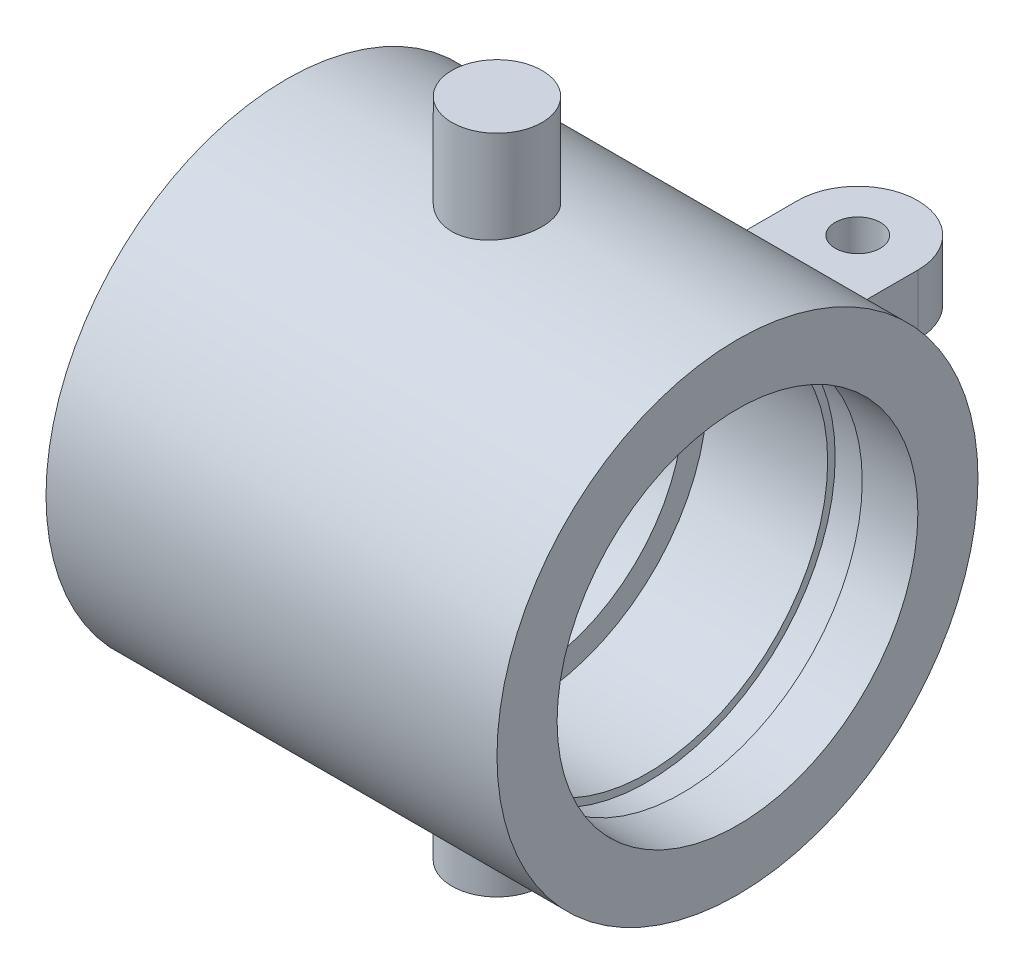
ISO-10303-21;
HEADER;
FILE_DESCRIPTION(('STEP AP214'),'2;1');
FILE_NAME('part.step','',(''),(''),'','','');
FILE_SCHEMA(('AUTOMOTIVE_DESIGN { 1 0 10303 214 1 1 1 1 }'));
ENDSEC;
DATA;
#1=APPLICATION_CONTEXT('core data for automotive mechanical design processes');
#2=APPLICATION_PROTOCOL_DEFINITION('international standard','automotive_design',2000,#1);
#3=PRODUCT_CONTEXT('',#1,'mechanical');
#4=PRODUCT('Part','Part','',(#3));
#5=PRODUCT_RELATED_PRODUCT_CATEGORY('part','',(#4));
#6=PRODUCT_DEFINITION_FORMATION('','',#4);
#7=PRODUCT_DEFINITION_CONTEXT('part definition',#1,'design');
#8=PRODUCT_DEFINITION('design','',#6,#7);
#9=PRODUCT_DEFINITION_SHAPE('','',#8);
#10=(LENGTH_UNIT() NAMED_UNIT(*) SI_UNIT(.MILLI.,.METRE.));
#11=(NAMED_UNIT(*) PLANE_ANGLE_UNIT() SI_UNIT($,.RADIAN.));
#12=(NAMED_UNIT(*) SI_UNIT($,.STERADIAN.) SOLID_ANGLE_UNIT());
#13=UNCERTAINTY_MEASURE_WITH_UNIT(LENGTH_MEASURE(1.E-05),#10,'distance_accuracy_value','');
#14=(GEOMETRIC_REPRESENTATION_CONTEXT(3) GLOBAL_UNCERTAINTY_ASSIGNED_CONTEXT((#13)) GLOBAL_UNIT_ASSIGNED_CONTEXT((#10,
#11,#12)) REPRESENTATION_CONTEXT('',''));
#15=CARTESIAN_POINT('',(0.,0.,0.));
#16=DIRECTION('',(0.,0.,1.));
#17=DIRECTION('',(1.,0.,0.));
#18=AXIS2_PLACEMENT_3D('',#15,#16,#17);
#19=CARTESIAN_POINT('',(53.,0.,0.));
#20=DIRECTION('',(1.,0.,0.));
#21=DIRECTION('',(0.,0.,-1.));
#22=AXIS2_PLACEMENT_3D('',#19,#20,#21);
#23=CYLINDRICAL_SURFACE('',#22,8.);
#24=CARTESIAN_POINT('',(68.,0.,0.));
#25=DIRECTION('',(1.,0.,0.));
#26=DIRECTION('',(0.,0.,-1.));
#27=AXIS2_PLACEMENT_3D('',#24,#25,#26);
#28=CIRCLE('',#27,8.);
#29=CARTESIAN_POINT('',(68.,0.,-8.));
#30=VERTEX_POINT('',#29);
#31=EDGE_CURVE('E123',#30,#30,#28,.T.);
#32=ORIENTED_EDGE('',*,*,#31,.F.);
#33=EDGE_LOOP('',(#32));
#34=FACE_BOUND('',#33,.T.);
#35=CARTESIAN_POINT('',(53.,0.,0.));
#36=DIRECTION('',(1.,0.,0.));
#37=DIRECTION('',(0.,0.,-1.));
#38=AXIS2_PLACEMENT_3D('',#35,#36,#37);
#39=CIRCLE('',#38,8.);
#40=CARTESIAN_POINT('',(53.,0.,-8.));
#41=VERTEX_POINT('',#40);
#42=EDGE_CURVE('E129',#41,#41,#39,.T.);
#43=ORIENTED_EDGE('',*,*,#42,.T.);
#44=EDGE_LOOP('',(#43));
#45=FACE_BOUND('',#44,.T.);
#46=CARTESIAN_POINT('',(60.,7.85811682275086,1.49999999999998));
#47=CARTESIAN_POINT('',(60.0834572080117,7.85811843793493,1.49999679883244));
#48=CARTESIAN_POINT('',(60.1669559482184,7.85946079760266,1.49301126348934));
#49=CARTESIAN_POINT('',(60.3315989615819,7.86467851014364,1.46527253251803));
#50=CARTESIAN_POINT('',(60.4127411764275,7.86855601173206,1.44450765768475));
#51=CARTESIAN_POINT('',(60.5702650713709,7.87838976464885,1.38987035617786));
#52=CARTESIAN_POINT('',(60.6466511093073,7.88434407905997,1.35601013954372));
#53=CARTESIAN_POINT('',(60.7926535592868,7.89765826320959,1.27617565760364));
#54=CARTESIAN_POINT('',(60.8622704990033,7.90501802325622,1.23020233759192));
#55=CARTESIAN_POINT('',(60.9936301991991,7.92041614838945,1.12683678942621));
#56=CARTESIAN_POINT('',(61.0552764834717,7.92846116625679,1.0693229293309));
#57=CARTESIAN_POINT('',(61.1681043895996,7.94426457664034,0.944771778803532));
#58=CARTESIAN_POINT('',(61.2192853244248,7.95202295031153,0.877733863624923));
#59=CARTESIAN_POINT('',(61.3100993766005,7.96645017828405,0.735403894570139));
#60=CARTESIAN_POINT('',(61.3496415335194,7.97311028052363,0.660052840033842));
#61=CARTESIAN_POINT('',(61.4154695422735,7.98451608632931,0.50363128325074));
#62=CARTESIAN_POINT('',(61.4417564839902,7.98926194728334,0.422561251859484));
#63=CARTESIAN_POINT('',(61.4800295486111,7.99625755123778,0.258002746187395));
#64=CARTESIAN_POINT('',(61.4921783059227,7.99853565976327,0.174553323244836));
#65=CARTESIAN_POINT('',(61.5023368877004,8.00043684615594,0.00677167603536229));
#66=CARTESIAN_POINT('',(61.5003479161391,8.00006015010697,-0.0775604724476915));
#67=CARTESIAN_POINT('',(61.4824122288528,7.99671633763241,-0.243598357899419));
#68=CARTESIAN_POINT('',(61.46664063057,7.99378172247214,-0.325323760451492));
#69=CARTESIAN_POINT('',(61.4218643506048,7.98568826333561,-0.484947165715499));
#70=CARTESIAN_POINT('',(61.3928591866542,7.98052933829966,-0.562845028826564));
#71=CARTESIAN_POINT('',(61.3222722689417,7.96851260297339,-0.713110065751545));
#72=CARTESIAN_POINT('',(61.2806205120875,7.96164537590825,-0.785443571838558));
#73=CARTESIAN_POINT('',(61.1859743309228,7.9469714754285,-0.922159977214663));
#74=CARTESIAN_POINT('',(61.1329787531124,7.93916470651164,-0.986542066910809));
#75=CARTESIAN_POINT('',(61.0161842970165,7.92333513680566,-1.10656561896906));
#76=CARTESIAN_POINT('',(60.9522322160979,7.91531085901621,-1.16205790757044));
#77=CARTESIAN_POINT('',(60.8158504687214,7.9000650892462,-1.26155171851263));
#78=CARTESIAN_POINT('',(60.7434206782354,7.8928436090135,-1.30555307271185));
#79=CARTESIAN_POINT('',(60.5919417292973,7.88001893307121,-1.3808585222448));
#80=CARTESIAN_POINT('',(60.5128815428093,7.8744185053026,-1.41214093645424));
#81=CARTESIAN_POINT('',(60.3504988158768,7.86551242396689,-1.46093656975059));
#82=CARTESIAN_POINT('',(60.2671767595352,7.86220651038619,-1.47845134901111));
#83=CARTESIAN_POINT('',(60.0999806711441,7.85831520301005,-1.49899672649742));
#84=CARTESIAN_POINT('',(60.0161338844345,7.85768955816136,-1.50224164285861));
#85=CARTESIAN_POINT('',(59.8490965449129,7.8591219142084,-1.49472968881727));
#86=CARTESIAN_POINT('',(59.7659059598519,7.86117978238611,-1.48397351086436));
#87=CARTESIAN_POINT('',(59.6032470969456,7.86770980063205,-1.44894868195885));
#88=CARTESIAN_POINT('',(59.5237537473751,7.87216186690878,-1.42479238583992));
#89=CARTESIAN_POINT('',(59.3699428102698,7.88296134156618,-1.36377224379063));
#90=CARTESIAN_POINT('',(59.2956256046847,7.88930888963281,-1.32690746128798));
#91=CARTESIAN_POINT('',(59.1533323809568,7.90327577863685,-1.24102353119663));
#92=CARTESIAN_POINT('',(59.0854394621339,7.91090895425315,-1.19186899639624));
#93=CARTESIAN_POINT('',(58.9587879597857,7.926548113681,-1.08298344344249));
#94=CARTESIAN_POINT('',(58.9000301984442,7.93455413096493,-1.02325147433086));
#95=CARTESIAN_POINT('',(58.7925162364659,7.95016624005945,-0.893949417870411));
#96=CARTESIAN_POINT('',(58.743904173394,7.95776555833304,-0.824258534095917));
#97=CARTESIAN_POINT('',(58.6590787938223,7.9715940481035,-0.677574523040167));
#98=CARTESIAN_POINT('',(58.622864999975,7.97782327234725,-0.600581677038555));
#99=CARTESIAN_POINT('',(58.5640799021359,7.98818057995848,-0.441877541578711));
#100=CARTESIAN_POINT('',(58.5414378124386,7.99231954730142,-0.360193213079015));
#101=CARTESIAN_POINT('',(58.5102129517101,7.99807642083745,-0.194096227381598));
#102=CARTESIAN_POINT('',(58.5016287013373,7.99969459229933,-0.109683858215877));
#103=CARTESIAN_POINT('',(58.4988146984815,8.00022227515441,0.058090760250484));
#104=CARTESIAN_POINT('',(58.5043672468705,7.99917286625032,0.141449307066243));
#105=CARTESIAN_POINT('',(58.5291924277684,7.99456866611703,0.306023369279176));
#106=CARTESIAN_POINT('',(58.5484649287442,7.99101389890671,0.387238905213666));
#107=CARTESIAN_POINT('',(58.6000912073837,7.98179837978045,0.545106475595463));
#108=CARTESIAN_POINT('',(58.632421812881,7.97614135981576,0.621766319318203));
#109=CARTESIAN_POINT('',(58.7092204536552,7.96333372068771,0.768605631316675));
#110=CARTESIAN_POINT('',(58.7536893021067,7.95618300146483,0.838784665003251));
#111=CARTESIAN_POINT('',(58.8542514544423,7.94104779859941,0.971755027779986));
#112=CARTESIAN_POINT('',(58.9105020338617,7.93305284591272,1.03442623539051));
#113=CARTESIAN_POINT('',(59.0327045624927,7.91719633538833,1.14951536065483));
#114=CARTESIAN_POINT('',(59.0986587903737,7.90933480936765,1.20193086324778));
#115=CARTESIAN_POINT('',(59.2391264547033,7.89455577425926,1.29547633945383));
#116=CARTESIAN_POINT('',(59.3137134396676,7.88764767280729,1.3364974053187));
#117=CARTESIAN_POINT('',(59.4688257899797,7.87567084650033,1.40536132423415));
#118=CARTESIAN_POINT('',(59.5493454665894,7.87060038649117,1.4332166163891));
#119=CARTESIAN_POINT('',(59.6917522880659,7.86393016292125,1.46929726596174));
#120=CARTESIAN_POINT('',(59.7528057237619,7.86176310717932,1.48079105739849));
#121=CARTESIAN_POINT('',(59.8758984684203,7.85885585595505,1.49614351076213));
#122=CARTESIAN_POINT('',(59.9379377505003,7.85811562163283,1.50000238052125));
#123=CARTESIAN_POINT('',(60.,7.85811682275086,1.49999999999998));
#124=B_SPLINE_CURVE_WITH_KNOTS('',3,(#46,#47,#48,#49,#50,#51,#52,#53,#54,#55,#56,#57,#58,#59,
#60,#61,#62,#63,#64,#65,#66,#67,#68,#69,#70,#71,#72,#73,#74,#75,#76,#77,#78,#79,#80,#81,#82,#83,
#84,#85,#86,#87,#88,#89,#90,#91,#92,#93,#94,#95,#96,#97,#98,#99,#100,#101,#102,#103,#104,#105,
#106,#107,#108,#109,#110,#111,#112,#113,#114,#115,#116,#117,#118,#119,#120,#121,#122,#123),
.UNSPECIFIED.,.T.,.F.,(4,2,2,2,2,2,2,2,2,2,2,2,2,2,2,2,2,2,2,2,2,2,2,2,2,2,2,2,2,2,2,2,2,2,2,2,
2,2,4),(0.,0.250144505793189,0.500501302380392,0.750625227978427,1.00072963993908,
1.25362335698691,1.50653367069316,1.76137104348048,2.01618745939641,2.26804275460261,
2.51987660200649,2.76855650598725,3.01724547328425,3.2673369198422,3.51745380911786,
3.77140614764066,4.02536220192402,4.27974936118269,4.53410768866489,4.78463248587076,
5.03514489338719,5.28358792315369,5.53204926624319,5.78337862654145,6.03473059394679,
6.28944125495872,6.54414210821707,6.79750269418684,7.05083661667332,7.3002930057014,
7.54974700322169,7.7987602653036,8.04779021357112,8.30038464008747,8.55303847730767,
8.8080300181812,9.06278015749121,9.24880307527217,9.43482092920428),.UNSPECIFIED.);
#125=CARTESIAN_POINT('',(60.,7.85811682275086,1.49999999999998));
#126=VERTEX_POINT('',#125);
#127=EDGE_CURVE('E132',#126,#126,#124,.T.);
#128=ORIENTED_EDGE('',*,*,#127,.F.);
#129=EDGE_LOOP('',(#128));
#130=FACE_BOUND('',#129,.T.);
#131=CARTESIAN_POINT('',(61.5,-8.,0.));
#132=CARTESIAN_POINT('',(61.4999968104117,-7.99999848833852,0.0834717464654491));
#133=CARTESIAN_POINT('',(61.4930089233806,-7.99868009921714,0.166984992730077));
#134=CARTESIAN_POINT('',(61.4652600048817,-7.9935478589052,0.331658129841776));
#135=CARTESIAN_POINT('',(61.4444873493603,-7.98973190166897,0.412815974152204));
#136=CARTESIAN_POINT('',(61.3898272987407,-7.98003138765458,0.570372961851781));
#137=CARTESIAN_POINT('',(61.3559517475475,-7.97414869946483,0.646776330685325));
#138=CARTESIAN_POINT('',(61.2760811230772,-7.96095710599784,0.792807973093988));
#139=CARTESIAN_POINT('',(61.2300870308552,-7.9536483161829,0.862436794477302));
#140=CARTESIAN_POINT('',(61.1267002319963,-7.93831336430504,0.993783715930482));
#141=CARTESIAN_POINT('',(61.0691905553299,-7.93028034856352,1.05540895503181));
#142=CARTESIAN_POINT('',(60.9446566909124,-7.91445318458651,1.16819606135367));
#143=CARTESIAN_POINT('',(60.8776318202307,-7.90665905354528,1.21935717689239));
#144=CARTESIAN_POINT('',(60.735313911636,-7.89212551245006,1.31014998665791));
#145=CARTESIAN_POINT('',(60.6599596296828,-7.88539493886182,1.34968721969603));
#146=CARTESIAN_POINT('',(60.5035310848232,-7.87384713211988,1.41550524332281));
#147=CARTESIAN_POINT('',(60.4224573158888,-7.86902973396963,1.44178717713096));
#148=CARTESIAN_POINT('',(60.2578847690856,-7.8619226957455,1.48005053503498));
#149=CARTESIAN_POINT('',(60.1744249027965,-7.85960445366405,1.49219390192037));
#150=CARTESIAN_POINT('',(60.0066226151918,-7.85767197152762,1.50233808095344));
#151=CARTESIAN_POINT('',(59.9222802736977,-7.8580574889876,1.50034016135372));
#152=CARTESIAN_POINT('',(59.756280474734,-7.86146292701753,1.48238979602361));
#153=CARTESIAN_POINT('',(59.6746022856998,-7.86444808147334,1.46662149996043));
#154=CARTESIAN_POINT('',(59.5150715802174,-7.87266183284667,1.42186799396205));
#155=CARTESIAN_POINT('',(59.4372192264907,-7.87789052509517,1.39288222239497));
#156=CARTESIAN_POINT('',(59.2870113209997,-7.89003855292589,1.32233647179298));
#157=CARTESIAN_POINT('',(59.2146915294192,-7.89696783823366,1.28070213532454));
#158=CARTESIAN_POINT('',(59.0779952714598,-7.91172971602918,1.18609368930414));
#159=CARTESIAN_POINT('',(59.0136196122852,-7.91956240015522,1.13311842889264));
#160=CARTESIAN_POINT('',(58.8935750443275,-7.93540001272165,1.01633905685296));
#161=CARTESIAN_POINT('',(58.8380593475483,-7.94340571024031,0.952377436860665));
#162=CARTESIAN_POINT('',(58.7385227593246,-7.95857386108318,0.815968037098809));
#163=CARTESIAN_POINT('',(58.6945019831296,-7.96573630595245,0.743520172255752));
#164=CARTESIAN_POINT('',(58.61918224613,-7.97842539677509,0.59203498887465));
#165=CARTESIAN_POINT('',(58.5878992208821,-7.98394999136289,0.512989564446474));
#166=CARTESIAN_POINT('',(58.5390979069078,-7.99272505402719,0.350639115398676));
#167=CARTESIAN_POINT('',(58.5215781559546,-7.99597576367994,0.267334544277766));
#168=CARTESIAN_POINT('',(58.5010139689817,-7.99980360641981,0.100148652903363));
#169=CARTESIAN_POINT('',(58.4977596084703,-8.00041950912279,0.0162940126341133));
#170=CARTESIAN_POINT('',(58.5052554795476,-7.99901543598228,-0.150761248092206));
#171=CARTESIAN_POINT('',(58.5160050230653,-7.99699558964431,-0.233961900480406));
#172=CARTESIAN_POINT('',(58.5510290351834,-7.99057111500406,-0.396681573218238));
#173=CARTESIAN_POINT('',(58.5751972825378,-7.98618522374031,-0.476224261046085));
#174=CARTESIAN_POINT('',(58.6362577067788,-7.97551842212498,-0.630128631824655));
#175=CARTESIAN_POINT('',(58.6731507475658,-7.96923738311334,-0.704489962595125));
#176=CARTESIAN_POINT('',(58.7590781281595,-7.95538030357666,-0.846816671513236));
#177=CARTESIAN_POINT('',(58.8082407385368,-7.94779086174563,-0.914703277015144));
#178=CARTESIAN_POINT('',(58.9171381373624,-7.93219343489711,-1.04133832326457));
#179=CARTESIAN_POINT('',(58.9768739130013,-7.92418541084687,-1.10008590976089));
#180=CARTESIAN_POINT('',(59.1061723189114,-7.9085247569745,-1.2075729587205));
#181=CARTESIAN_POINT('',(59.1758549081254,-7.90087825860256,-1.25616916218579));
#182=CARTESIAN_POINT('',(59.3225176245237,-7.88692985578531,-1.34096675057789));
#183=CARTESIAN_POINT('',(59.3994974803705,-7.88062790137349,-1.37716859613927));
#184=CARTESIAN_POINT('',(59.5582058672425,-7.87013024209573,-1.43594673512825));
#185=CARTESIAN_POINT('',(59.6399093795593,-7.86592440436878,-1.45858868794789));
#186=CARTESIAN_POINT('',(59.8060472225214,-7.86007203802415,-1.48980679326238));
#187=CARTESIAN_POINT('',(59.8904812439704,-7.85842522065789,-1.49838453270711));
#188=CARTESIAN_POINT('',(60.0582483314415,-7.85789199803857,-1.50117762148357));
#189=CARTESIAN_POINT('',(60.141577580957,-7.85896215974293,-1.49561895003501));
#190=CARTESIAN_POINT('',(60.3060914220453,-7.86364600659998,-1.47079175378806));
#191=CARTESIAN_POINT('',(60.3872760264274,-7.86725967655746,-1.45152331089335));
#192=CARTESIAN_POINT('',(60.5450744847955,-7.87660508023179,-1.39991887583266));
#193=CARTESIAN_POINT('',(60.6216965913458,-7.88233284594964,-1.36760735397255));
#194=CARTESIAN_POINT('',(60.7684682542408,-7.8952638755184,-1.29085868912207));
#195=CARTESIAN_POINT('',(60.8386173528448,-7.90246724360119,-1.24642068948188));
#196=CARTESIAN_POINT('',(60.9715836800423,-7.91767266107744,-1.14589487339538));
#197=CARTESIAN_POINT('',(61.0342754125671,-7.92568505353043,-1.08964259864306));
#198=CARTESIAN_POINT('',(61.1494051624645,-7.94152833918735,-0.967427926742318));
#199=CARTESIAN_POINT('',(61.2018408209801,-7.94935919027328,-0.901463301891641));
#200=CARTESIAN_POINT('',(61.2954109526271,-7.96403975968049,-0.760984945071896));
#201=CARTESIAN_POINT('',(61.3364394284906,-7.97088000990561,-0.686399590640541));
#202=CARTESIAN_POINT('',(61.4053176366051,-7.98271619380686,-0.531290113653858));
#203=CARTESIAN_POINT('',(61.4331797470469,-7.98771385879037,-0.450771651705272));
#204=CARTESIAN_POINT('',(61.4692773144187,-7.99428290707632,-0.308347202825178));
#205=CARTESIAN_POINT('',(61.4807786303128,-7.99641470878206,-0.247273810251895));
#206=CARTESIAN_POINT('',(61.4961410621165,-7.9992737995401,-0.124141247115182));
#207=CARTESIAN_POINT('',(61.5000023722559,-8.00000112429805,-0.0620821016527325));
#208=CARTESIAN_POINT('',(61.5,-8.,0.));
#209=B_SPLINE_CURVE_WITH_KNOTS('',3,(#131,#132,#133,#134,#135,#136,#137,#138,#139,#140,#141,
#142,#143,#144,#145,#146,#147,#148,#149,#150,#151,#152,#153,#154,#155,#156,#157,#158,#159,#160,
#161,#162,#163,#164,#165,#166,#167,#168,#169,#170,#171,#172,#173,#174,#175,#176,#177,#178,#179,
#180,#181,#182,#183,#184,#185,#186,#187,#188,#189,#190,#191,#192,#193,#194,#195,#196,#197,#198,
#199,#200,#201,#202,#203,#204,#205,#206,#207,#208),.UNSPECIFIED.,.T.,.F.,(4,2,2,2,2,2,2,2,2,2,2,
2,2,2,2,2,2,2,2,2,2,2,2,2,2,2,2,2,2,2,2,2,2,2,2,2,2,2,4),(0.,0.250188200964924,
0.500587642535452,0.75076127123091,1.00091465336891,1.2537511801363,1.50660586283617,
1.76146190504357,2.01629596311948,2.26818151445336,2.52004447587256,2.76859000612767,
3.01714609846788,3.26719262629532,3.5172645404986,3.77127768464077,4.02529337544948,
4.27962588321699,4.53393136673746,4.78448174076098,5.03501980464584,5.28360233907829,
5.53220175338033,5.7835177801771,6.03485728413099,6.28953436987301,6.54420198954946,
6.7976262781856,7.05102196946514,7.30039252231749,7.54976158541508,7.79866496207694,
8.04758592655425,8.30023369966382,8.55293951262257,8.80792048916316,9.06266126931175,
9.24874344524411,9.43482089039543),.UNSPECIFIED.);
#210=CARTESIAN_POINT('',(61.5,-8.,0.));
#211=VERTEX_POINT('',#210);
#212=EDGE_CURVE('E142',#211,#211,#209,.T.);
#213=ORIENTED_EDGE('',*,*,#212,.F.);
#214=EDGE_LOOP('',(#213));
#215=FACE_BOUND('',#214,.T.);
#216=DIRECTION('',(1.,0.,0.));
#217=VECTOR('',#216,1.);
#218=CARTESIAN_POINT('',(53.,-1.,-7.93725393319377));
#219=LINE('',#218,#217);
#220=CARTESIAN_POINT('',(62.,-1.,-7.93725393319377));
#221=VERTEX_POINT('',#220);
#222=CARTESIAN_POINT('',(58.,-1.,-7.93725393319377));
#223=VERTEX_POINT('',#222);
#224=EDGE_CURVE('E40',#221,#223,#219,.F.);
#225=ORIENTED_EDGE('',*,*,#224,.F.);
#226=CARTESIAN_POINT('',(62.,0.,0.));
#227=DIRECTION('',(-1.,0.,0.));
#228=DIRECTION('',(0.,0.,1.));
#229=AXIS2_PLACEMENT_3D('',#226,#227,#228);
#230=CIRCLE('',#229,8.);
#231=CARTESIAN_POINT('',(62.,1.,-7.93725393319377));
#232=VERTEX_POINT('',#231);
#233=EDGE_CURVE('E94',#221,#232,#230,.F.);
#234=ORIENTED_EDGE('',*,*,#233,.T.);
#235=DIRECTION('',(1.,0.,0.));
#236=VECTOR('',#235,1.);
#237=CARTESIAN_POINT('',(53.,1.,-7.93725393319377));
#238=LINE('',#237,#236);
#239=CARTESIAN_POINT('',(58.,1.,-7.93725393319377));
#240=VERTEX_POINT('',#239);
#241=EDGE_CURVE('E11',#232,#240,#238,.F.);
#242=ORIENTED_EDGE('',*,*,#241,.T.);
#243=CARTESIAN_POINT('',(58.,0.,0.));
#244=DIRECTION('',(1.,0.,0.));
#245=DIRECTION('',(0.,0.,-1.));
#246=AXIS2_PLACEMENT_3D('',#243,#244,#245);
#247=CIRCLE('',#246,8.);
#248=EDGE_CURVE('E52',#240,#223,#247,.F.);
#249=ORIENTED_EDGE('',*,*,#248,.T.);
#250=EDGE_LOOP('',(#225,#234,#242,#249));
#251=FACE_BOUND('',#250,.T.);
#252=ADVANCED_FACE('F32',(#34,#45,#130,#215,#251),#23,.T.);
#253=CARTESIAN_POINT('',(61.,0.,0.));
#254=DIRECTION('',(1.,0.,0.));
#255=DIRECTION('',(0.,0.,-1.));
#256=AXIS2_PLACEMENT_3D('',#253,#254,#255);
#257=CYLINDRICAL_SURFACE('',#256,6.);
#258=CARTESIAN_POINT('',(66.15,0.,0.));
#259=DIRECTION('',(1.,0.,0.));
#260=DIRECTION('',(0.,0.,-1.));
#261=AXIS2_PLACEMENT_3D('',#258,#259,#260);
#262=CIRCLE('',#261,6.);
#263=CARTESIAN_POINT('',(66.15,0.,-6.));
#264=VERTEX_POINT('',#263);
#265=EDGE_CURVE('E119',#264,#264,#262,.T.);
#266=ORIENTED_EDGE('',*,*,#265,.F.);
#267=EDGE_LOOP('',(#266));
#268=FACE_BOUND('',#267,.T.);
#269=CARTESIAN_POINT('',(68.,0.,0.));
#270=DIRECTION('',(1.,0.,0.));
#271=DIRECTION('',(0.,0.,-1.));
#272=AXIS2_PLACEMENT_3D('',#269,#270,#271);
#273=CIRCLE('',#272,6.);
#274=CARTESIAN_POINT('',(68.,0.,-6.));
#275=VERTEX_POINT('',#274);
#276=EDGE_CURVE('E120',#275,#275,#273,.T.);
#277=ORIENTED_EDGE('',*,*,#276,.T.);
#278=EDGE_LOOP('',(#277));
#279=FACE_BOUND('',#278,.T.);
#280=ADVANCED_FACE('F177',(#268,#279),#257,.F.);
#281=CARTESIAN_POINT('',(68.,0.,0.));
#282=DIRECTION('',(1.,0.,0.));
#283=DIRECTION('',(0.,0.,-1.));
#284=AXIS2_PLACEMENT_3D('',#281,#282,#283);
#285=PLANE('',#284);
#286=ORIENTED_EDGE('',*,*,#31,.T.);
#287=EDGE_LOOP('',(#286));
#288=FACE_BOUND('',#287,.T.);
#289=ORIENTED_EDGE('',*,*,#276,.F.);
#290=EDGE_LOOP('',(#289));
#291=FACE_BOUND('',#290,.T.);
#292=ADVANCED_FACE('F174',(#288,#291),#285,.T.);
#293=CARTESIAN_POINT('',(53.,0.,0.));
#294=DIRECTION('',(1.,0.,0.));
#295=DIRECTION('',(0.,0.,-1.));
#296=AXIS2_PLACEMENT_3D('',#293,#294,#295);
#297=PLANE('',#296);
#298=CARTESIAN_POINT('',(53.,0.,0.));
#299=DIRECTION('',(1.,0.,0.));
#300=DIRECTION('',(0.,0.,-1.));
#301=AXIS2_PLACEMENT_3D('',#298,#299,#300);
#302=CIRCLE('',#301,5.2);
#303=CARTESIAN_POINT('',(53.,0.,-5.2));
#304=VERTEX_POINT('',#303);
#305=EDGE_CURVE('E107',#304,#304,#302,.T.);
#306=ORIENTED_EDGE('',*,*,#305,.T.);
#307=EDGE_LOOP('',(#306));
#308=FACE_BOUND('',#307,.T.);
#309=ORIENTED_EDGE('',*,*,#42,.F.);
#310=EDGE_LOOP('',(#309));
#311=FACE_BOUND('',#310,.T.);
#312=ADVANCED_FACE('F172',(#308,#311),#297,.F.);
#313=CARTESIAN_POINT('',(66.15,0.,0.));
#314=DIRECTION('',(-1.,0.,0.));
#315=DIRECTION('',(0.,0.,1.));
#316=AXIS2_PLACEMENT_3D('',#313,#314,#315);
#317=CYLINDRICAL_SURFACE('',#316,6.25);
#318=CARTESIAN_POINT('',(66.15,0.,0.));
#319=DIRECTION('',(1.,0.,0.));
#320=DIRECTION('',(0.,0.,-1.));
#321=AXIS2_PLACEMENT_3D('',#318,#319,#320);
#322=CIRCLE('',#321,6.25);
#323=CARTESIAN_POINT('',(66.15,0.,-6.25));
#324=VERTEX_POINT('',#323);
#325=EDGE_CURVE('E111',#324,#324,#322,.T.);
#326=ORIENTED_EDGE('',*,*,#325,.T.);
#327=EDGE_LOOP('',(#326));
#328=FACE_BOUND('',#327,.T.);
#329=CARTESIAN_POINT('',(65.,0.,0.));
#330=DIRECTION('',(1.,0.,0.));
#331=DIRECTION('',(0.,0.,-1.));
#332=AXIS2_PLACEMENT_3D('',#329,#330,#331);
#333=CIRCLE('',#332,6.25);
#334=CARTESIAN_POINT('',(65.,0.,-6.25));
#335=VERTEX_POINT('',#334);
#336=EDGE_CURVE('E110',#335,#335,#333,.T.);
#337=ORIENTED_EDGE('',*,*,#336,.F.);
#338=EDGE_LOOP('',(#337));
#339=FACE_BOUND('',#338,.T.);
#340=ADVANCED_FACE('F164',(#328,#339),#317,.F.);
#341=CARTESIAN_POINT('',(66.15,0.,0.));
#342=DIRECTION('',(1.,0.,0.));
#343=DIRECTION('',(0.,0.,-1.));
#344=AXIS2_PLACEMENT_3D('',#341,#342,#343);
#345=PLANE('',#344);
#346=ORIENTED_EDGE('',*,*,#265,.T.);
#347=EDGE_LOOP('',(#346));
#348=FACE_BOUND('',#347,.T.);
#349=ORIENTED_EDGE('',*,*,#325,.F.);
#350=EDGE_LOOP('',(#349));
#351=FACE_BOUND('',#350,.T.);
#352=ADVANCED_FACE('F160',(#348,#351),#345,.F.);
#353=CARTESIAN_POINT('',(65.,0.,0.));
#354=DIRECTION('',(1.,0.,0.));
#355=DIRECTION('',(0.,0.,-1.));
#356=AXIS2_PLACEMENT_3D('',#353,#354,#355);
#357=PLANE('',#356);
#358=CARTESIAN_POINT('',(65.,0.,0.));
#359=DIRECTION('',(1.,0.,0.));
#360=DIRECTION('',(0.,0.,-1.));
#361=AXIS2_PLACEMENT_3D('',#358,#359,#360);
#362=CIRCLE('',#361,6.);
#363=CARTESIAN_POINT('',(65.,0.,-6.));
#364=VERTEX_POINT('',#363);
#365=EDGE_CURVE('E114',#364,#364,#362,.T.);
#366=ORIENTED_EDGE('',*,*,#365,.F.);
#367=EDGE_LOOP('',(#366));
#368=FACE_BOUND('',#367,.T.);
#369=ORIENTED_EDGE('',*,*,#336,.T.);
#370=EDGE_LOOP('',(#369));
#371=FACE_BOUND('',#370,.T.);
#372=ADVANCED_FACE('F163',(#368,#371),#357,.T.);
#373=CARTESIAN_POINT('',(61.,0.,0.));
#374=DIRECTION('',(-1.,0.,0.));
#375=DIRECTION('',(0.,0.,1.));
#376=AXIS2_PLACEMENT_3D('',#373,#374,#375);
#377=PLANE('',#376);
#378=CARTESIAN_POINT('',(61.,0.,0.));
#379=DIRECTION('',(-1.,0.,0.));
#380=DIRECTION('',(0.,0.,1.));
#381=AXIS2_PLACEMENT_3D('',#378,#379,#380);
#382=CIRCLE('',#381,5.2);
#383=CARTESIAN_POINT('',(61.,0.,5.2));
#384=VERTEX_POINT('',#383);
#385=EDGE_CURVE('E106',#384,#384,#382,.T.);
#386=ORIENTED_EDGE('',*,*,#385,.T.);
#387=EDGE_LOOP('',(#386));
#388=FACE_BOUND('',#387,.T.);
#389=CARTESIAN_POINT('',(61.,0.,0.));
#390=DIRECTION('',(-1.,0.,0.));
#391=DIRECTION('',(0.,0.,1.));
#392=AXIS2_PLACEMENT_3D('',#389,#390,#391);
#393=CIRCLE('',#392,6.);
#394=CARTESIAN_POINT('',(61.,0.,6.));
#395=VERTEX_POINT('',#394);
#396=EDGE_CURVE('E126',#395,#395,#393,.T.);
#397=ORIENTED_EDGE('',*,*,#396,.F.);
#398=EDGE_LOOP('',(#397));
#399=FACE_BOUND('',#398,.T.);
#400=ADVANCED_FACE('F168',(#388,#399),#377,.F.);
#401=ORIENTED_EDGE('',*,*,#396,.T.);
#402=EDGE_LOOP('',(#401));
#403=FACE_BOUND('',#402,.T.);
#404=ORIENTED_EDGE('',*,*,#365,.T.);
#405=EDGE_LOOP('',(#404));
#406=FACE_BOUND('',#405,.T.);
#407=ADVANCED_FACE('F158',(#403,#406),#257,.F.);
#408=CARTESIAN_POINT('',(-90.,0.,0.));
#409=DIRECTION('',(1.,0.,0.));
#410=DIRECTION('',(0.,0.,-1.));
#411=AXIS2_PLACEMENT_3D('',#408,#409,#410);
#412=CYLINDRICAL_SURFACE('',#411,5.2);
#413=ORIENTED_EDGE('',*,*,#385,.F.);
#414=EDGE_LOOP('',(#413));
#415=FACE_BOUND('',#414,.T.);
#416=ORIENTED_EDGE('',*,*,#305,.F.);
#417=EDGE_LOOP('',(#416));
#418=FACE_BOUND('',#417,.T.);
#419=ADVANCED_FACE('F155',(#415,#418),#412,.F.);
#420=CARTESIAN_POINT('',(60.,11.,0.));
#421=DIRECTION('',(0.,1.,0.));
#422=DIRECTION('',(0.,0.,1.));
#423=AXIS2_PLACEMENT_3D('',#420,#421,#422);
#424=PLANE('',#423);
#425=CARTESIAN_POINT('',(60.,11.,0.));
#426=DIRECTION('',(0.,1.,0.));
#427=DIRECTION('',(0.,0.,1.));
#428=AXIS2_PLACEMENT_3D('',#425,#426,#427);
#429=CIRCLE('',#428,1.5);
#430=CARTESIAN_POINT('',(60.,11.,1.49999999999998));
#431=VERTEX_POINT('',#430);
#432=EDGE_CURVE('E103',#431,#431,#429,.T.);
#433=ORIENTED_EDGE('',*,*,#432,.T.);
#434=EDGE_LOOP('',(#433));
#435=FACE_BOUND('',#434,.T.);
#436=ADVANCED_FACE('F153',(#435),#424,.T.);
#437=CARTESIAN_POINT('',(60.,-18.001,0.));
#438=DIRECTION('',(0.,1.,0.));
#439=DIRECTION('',(0.,0.,1.));
#440=AXIS2_PLACEMENT_3D('',#437,#438,#439);
#441=CYLINDRICAL_SURFACE('',#440,1.5);
#442=ORIENTED_EDGE('',*,*,#127,.T.);
#443=EDGE_LOOP('',(#442));
#444=FACE_BOUND('',#443,.T.);
#445=ORIENTED_EDGE('',*,*,#432,.F.);
#446=EDGE_LOOP('',(#445));
#447=FACE_BOUND('',#446,.T.);
#448=ADVANCED_FACE('F147',(#444,#447),#441,.T.);
#449=CARTESIAN_POINT('',(60.,-11.,0.));
#450=DIRECTION('',(0.,-1.,0.));
#451=DIRECTION('',(1.,0.,0.));
#452=AXIS2_PLACEMENT_3D('',#449,#450,#451);
#453=PLANE('',#452);
#454=CARTESIAN_POINT('',(60.,-11.,0.));
#455=DIRECTION('',(0.,-1.,0.));
#456=DIRECTION('',(1.,0.,0.));
#457=AXIS2_PLACEMENT_3D('',#454,#455,#456);
#458=CIRCLE('',#457,1.5);
#459=CARTESIAN_POINT('',(61.5,-11.,0.));
#460=VERTEX_POINT('',#459);
#461=EDGE_CURVE('E96',#460,#460,#458,.T.);
#462=ORIENTED_EDGE('',*,*,#461,.T.);
#463=EDGE_LOOP('',(#462));
#464=FACE_BOUND('',#463,.T.);
#465=ADVANCED_FACE('F152',(#464),#453,.T.);
#466=CARTESIAN_POINT('',(60.,11.001,0.));
#467=DIRECTION('',(0.,-1.,0.));
#468=DIRECTION('',(1.,0.,0.));
#469=AXIS2_PLACEMENT_3D('',#466,#467,#468);
#470=CYLINDRICAL_SURFACE('',#469,1.5);
#471=ORIENTED_EDGE('',*,*,#212,.T.);
#472=EDGE_LOOP('',(#471));
#473=FACE_BOUND('',#472,.T.);
#474=ORIENTED_EDGE('',*,*,#461,.F.);
#475=EDGE_LOOP('',(#474));
#476=FACE_BOUND('',#475,.T.);
#477=ADVANCED_FACE('F205',(#473,#476),#470,.T.);
#478=CARTESIAN_POINT('',(60.,1.,-12.));
#479=DIRECTION('',(0.,-1.,0.));
#480=DIRECTION('',(0.,0.,-1.));
#481=AXIS2_PLACEMENT_3D('',#478,#479,#480);
#482=PLANE('',#481);
#483=ORIENTED_EDGE('',*,*,#241,.F.);
#484=DIRECTION('',(0.,0.,-1.));
#485=VECTOR('',#484,1.);
#486=CARTESIAN_POINT('',(62.,1.,-12.));
#487=LINE('',#486,#485);
#488=CARTESIAN_POINT('',(62.,1.,-12.));
#489=VERTEX_POINT('',#488);
#490=EDGE_CURVE('E73',#232,#489,#487,.T.);
#491=ORIENTED_EDGE('',*,*,#490,.T.);
#492=CARTESIAN_POINT('',(60.,1.,-12.));
#493=DIRECTION('',(0.,1.,0.));
#494=DIRECTION('',(0.,0.,-1.));
#495=AXIS2_PLACEMENT_3D('',#492,#493,#494);
#496=CIRCLE('',#495,2.);
#497=CARTESIAN_POINT('',(58.,1.,-12.));
#498=VERTEX_POINT('',#497);
#499=EDGE_CURVE('E77',#489,#498,#496,.T.);
#500=ORIENTED_EDGE('',*,*,#499,.T.);
#501=DIRECTION('',(0.,0.,1.));
#502=VECTOR('',#501,1.);
#503=CARTESIAN_POINT('',(58.,1.,-6.));
#504=LINE('',#503,#502);
#505=EDGE_CURVE('E88',#498,#240,#504,.T.);
#506=ORIENTED_EDGE('',*,*,#505,.T.);
#507=EDGE_LOOP('',(#483,#491,#500,#506));
#508=FACE_BOUND('',#507,.T.);
#509=CARTESIAN_POINT('',(60.,1.,-12.));
#510=DIRECTION('',(0.,1.,0.));
#511=DIRECTION('',(0.,0.,1.));
#512=AXIS2_PLACEMENT_3D('',#509,#510,#511);
#513=CIRCLE('',#512,0.749999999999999);
#514=CARTESIAN_POINT('',(60.,1.,-11.25));
#515=VERTEX_POINT('',#514);
#516=EDGE_CURVE('E236',#515,#515,#513,.T.);
#517=ORIENTED_EDGE('',*,*,#516,.F.);
#518=EDGE_LOOP('',(#517));
#519=FACE_BOUND('',#518,.T.);
#520=ADVANCED_FACE('F75',(#508,#519),#482,.F.);
#521=CARTESIAN_POINT('',(60.,-1.,-12.));
#522=DIRECTION('',(0.,-1.,0.));
#523=DIRECTION('',(0.,0.,-1.));
#524=AXIS2_PLACEMENT_3D('',#521,#522,#523);
#525=PLANE('',#524);
#526=DIRECTION('',(0.,0.,-1.));
#527=VECTOR('',#526,1.);
#528=CARTESIAN_POINT('',(62.,-1.,-12.));
#529=LINE('',#528,#527);
#530=CARTESIAN_POINT('',(62.,-1.,-12.));
#531=VERTEX_POINT('',#530);
#532=EDGE_CURVE('E92',#221,#531,#529,.T.);
#533=ORIENTED_EDGE('',*,*,#532,.F.);
#534=ORIENTED_EDGE('',*,*,#224,.T.);
#535=DIRECTION('',(0.,0.,1.));
#536=VECTOR('',#535,1.);
#537=CARTESIAN_POINT('',(58.,-1.,-6.));
#538=LINE('',#537,#536);
#539=CARTESIAN_POINT('',(58.,-1.,-12.));
#540=VERTEX_POINT('',#539);
#541=EDGE_CURVE('E47',#540,#223,#538,.T.);
#542=ORIENTED_EDGE('',*,*,#541,.F.);
#543=CARTESIAN_POINT('',(60.,-1.,-12.));
#544=DIRECTION('',(0.,1.,0.));
#545=DIRECTION('',(0.,0.,-1.));
#546=AXIS2_PLACEMENT_3D('',#543,#544,#545);
#547=CIRCLE('',#546,2.);
#548=EDGE_CURVE('E246',#531,#540,#547,.T.);
#549=ORIENTED_EDGE('',*,*,#548,.F.);
#550=EDGE_LOOP('',(#533,#534,#542,#549));
#551=FACE_BOUND('',#550,.T.);
#552=CARTESIAN_POINT('',(60.,-1.,-12.));
#553=DIRECTION('',(0.,1.,0.));
#554=DIRECTION('',(0.,0.,1.));
#555=AXIS2_PLACEMENT_3D('',#552,#553,#554);
#556=CIRCLE('',#555,0.749999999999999);
#557=CARTESIAN_POINT('',(60.,-1.,-11.25));
#558=VERTEX_POINT('',#557);
#559=EDGE_CURVE('E239',#558,#558,#556,.T.);
#560=ORIENTED_EDGE('',*,*,#559,.T.);
#561=EDGE_LOOP('',(#560));
#562=FACE_BOUND('',#561,.T.);
#563=ADVANCED_FACE('F218',(#551,#562),#525,.T.);
#564=CARTESIAN_POINT('',(62.,1.,-12.));
#565=DIRECTION('',(-1.,0.,0.));
#566=DIRECTION('',(0.,0.,1.));
#567=AXIS2_PLACEMENT_3D('',#564,#565,#566);
#568=PLANE('',#567);
#569=ORIENTED_EDGE('',*,*,#233,.F.);
#570=ORIENTED_EDGE('',*,*,#532,.T.);
#571=DIRECTION('',(0.,-1.,0.));
#572=VECTOR('',#571,1.);
#573=CARTESIAN_POINT('',(62.,1.,-12.));
#574=LINE('',#573,#572);
#575=EDGE_CURVE('E86',#489,#531,#574,.T.);
#576=ORIENTED_EDGE('',*,*,#575,.F.);
#577=ORIENTED_EDGE('',*,*,#490,.F.);
#578=EDGE_LOOP('',(#569,#570,#576,#577));
#579=FACE_BOUND('',#578,.T.);
#580=ADVANCED_FACE('F90',(#579),#568,.F.);
#581=CARTESIAN_POINT('',(60.,1.,-12.));
#582=DIRECTION('',(0.,-1.,0.));
#583=DIRECTION('',(0.,0.,-1.));
#584=AXIS2_PLACEMENT_3D('',#581,#582,#583);
#585=CYLINDRICAL_SURFACE('',#584,2.);
#586=ORIENTED_EDGE('',*,*,#548,.T.);
#587=DIRECTION('',(0.,-1.,0.));
#588=VECTOR('',#587,1.);
#589=CARTESIAN_POINT('',(58.,1.,-12.));
#590=LINE('',#589,#588);
#591=EDGE_CURVE('E87',#498,#540,#590,.T.);
#592=ORIENTED_EDGE('',*,*,#591,.F.);
#593=ORIENTED_EDGE('',*,*,#499,.F.);
#594=ORIENTED_EDGE('',*,*,#575,.T.);
#595=EDGE_LOOP('',(#586,#592,#593,#594));
#596=FACE_BOUND('',#595,.T.);
#597=ADVANCED_FACE('F85',(#596),#585,.T.);
#598=CARTESIAN_POINT('',(58.,1.,-6.));
#599=DIRECTION('',(1.,0.,0.));
#600=DIRECTION('',(0.,0.,-1.));
#601=AXIS2_PLACEMENT_3D('',#598,#599,#600);
#602=PLANE('',#601);
#603=ORIENTED_EDGE('',*,*,#248,.F.);
#604=ORIENTED_EDGE('',*,*,#505,.F.);
#605=ORIENTED_EDGE('',*,*,#591,.T.);
#606=ORIENTED_EDGE('',*,*,#541,.T.);
#607=EDGE_LOOP('',(#603,#604,#605,#606));
#608=FACE_BOUND('',#607,.T.);
#609=ADVANCED_FACE('F221',(#608),#602,.F.);
#610=CARTESIAN_POINT('',(60.,1.,-12.));
#611=DIRECTION('',(0.,-1.,0.));
#612=DIRECTION('',(0.,0.,-1.));
#613=AXIS2_PLACEMENT_3D('',#610,#611,#612);
#614=CYLINDRICAL_SURFACE('',#613,0.749999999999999);
#615=ORIENTED_EDGE('',*,*,#516,.T.);
#616=EDGE_LOOP('',(#615));
#617=FACE_BOUND('',#616,.T.);
#618=ORIENTED_EDGE('',*,*,#559,.F.);
#619=EDGE_LOOP('',(#618));
#620=FACE_BOUND('',#619,.T.);
#621=ADVANCED_FACE('F224',(#617,#620),#614,.F.);
#622=CLOSED_SHELL('',(#252,#280,#292,#312,#340,#352,#372,#400,#407,#419,#436,#448,#465,#477,
#520,#563,#580,#597,#609,#621));
#623=MANIFOLD_SOLID_BREP('B2',#622);
#624=ADVANCED_BREP_SHAPE_REPRESENTATION('',(#18,#623),#14);
#625=SHAPE_DEFINITION_REPRESENTATION(#9,#624);
ENDSEC;
END-ISO-10303-21;
